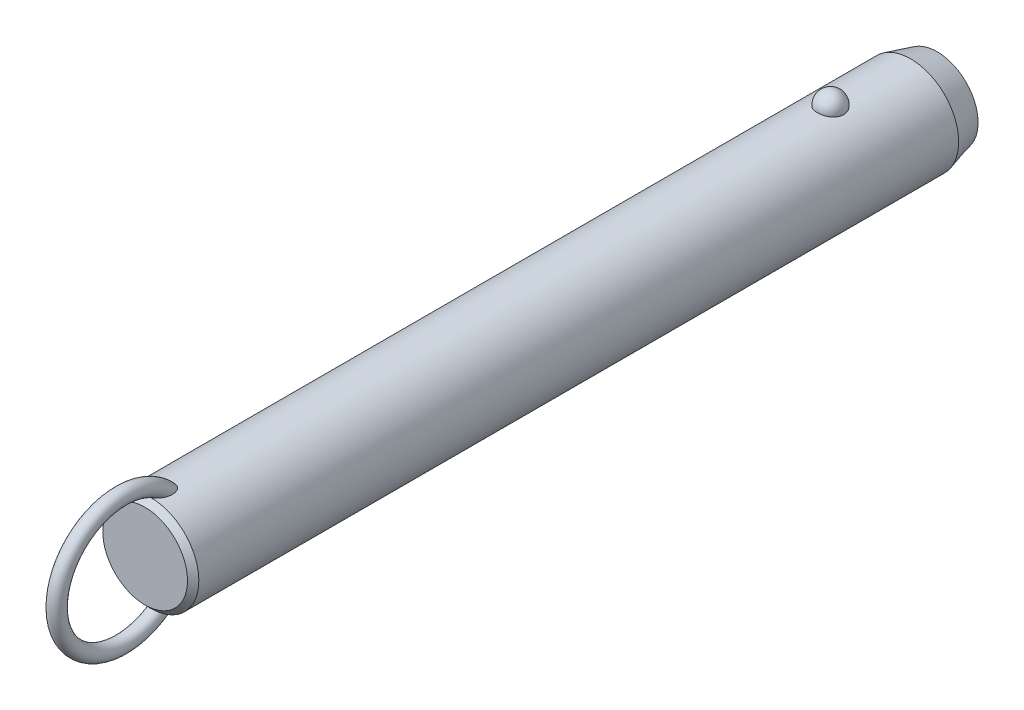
ISO-10303-21;
HEADER;
FILE_DESCRIPTION(('STEP AP214'),'2;1');
FILE_NAME('part.step','',(''),(''),'','','');
FILE_SCHEMA(('AUTOMOTIVE_DESIGN { 1 0 10303 214 1 1 1 1 }'));
ENDSEC;
DATA;
#1=APPLICATION_CONTEXT('core data for automotive mechanical design processes');
#2=APPLICATION_PROTOCOL_DEFINITION('international standard','automotive_design',2000,#1);
#3=PRODUCT_CONTEXT('',#1,'mechanical');
#4=PRODUCT('Part','Part','',(#3));
#5=PRODUCT_RELATED_PRODUCT_CATEGORY('part','',(#4));
#6=PRODUCT_DEFINITION_FORMATION('','',#4);
#7=PRODUCT_DEFINITION_CONTEXT('part definition',#1,'design');
#8=PRODUCT_DEFINITION('design','',#6,#7);
#9=PRODUCT_DEFINITION_SHAPE('','',#8);
#10=(LENGTH_UNIT() NAMED_UNIT(*) SI_UNIT(.MILLI.,.METRE.));
#11=(NAMED_UNIT(*) PLANE_ANGLE_UNIT() SI_UNIT($,.RADIAN.));
#12=(NAMED_UNIT(*) SI_UNIT($,.STERADIAN.) SOLID_ANGLE_UNIT());
#13=UNCERTAINTY_MEASURE_WITH_UNIT(LENGTH_MEASURE(1.E-05),#10,'distance_accuracy_value','');
#14=(GEOMETRIC_REPRESENTATION_CONTEXT(3) GLOBAL_UNCERTAINTY_ASSIGNED_CONTEXT((#13)) GLOBAL_UNIT_ASSIGNED_CONTEXT((#10,
#11,#12)) REPRESENTATION_CONTEXT('',''));
#15=CARTESIAN_POINT('',(0.,0.,0.));
#16=DIRECTION('',(0.,0.,1.));
#17=DIRECTION('',(1.,0.,0.));
#18=AXIS2_PLACEMENT_3D('',#15,#16,#17);
#19=CARTESIAN_POINT('',(0.,0.,165.1));
#20=DIRECTION('',(0.,0.,-1.));
#21=DIRECTION('',(-1.,0.,0.));
#22=AXIS2_PLACEMENT_3D('',#19,#20,#21);
#23=CYLINDRICAL_SURFACE('',#22,12.7);
#24=CARTESIAN_POINT('',(3.46661256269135,12.2177165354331,-3.50000000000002));
#25=CARTESIAN_POINT('',(3.4666090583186,12.2177194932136,-3.30432790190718));
#26=CARTESIAN_POINT('',(3.45063567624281,12.2222841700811,-3.10861112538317));
#27=CARTESIAN_POINT('',(3.38712451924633,12.2400345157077,-2.72271899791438));
#28=CARTESIAN_POINT('',(3.33957415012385,12.2532236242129,-2.53254588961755));
#29=CARTESIAN_POINT('',(3.2141234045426,12.286724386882,-2.16324948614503));
#30=CARTESIAN_POINT('',(3.13623639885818,12.3070329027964,-1.98412136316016));
#31=CARTESIAN_POINT('',(2.95205930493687,12.3525018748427,-1.6418059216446));
#32=CARTESIAN_POINT('',(2.84577003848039,12.3776621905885,-1.47861814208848));
#33=CARTESIAN_POINT('',(2.60688050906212,12.4301712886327,-1.17190583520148));
#34=CARTESIAN_POINT('',(2.47415697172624,12.4575299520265,-1.0284789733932));
#35=CARTESIAN_POINT('',(2.18615174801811,12.5112810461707,-0.766177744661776));
#36=CARTESIAN_POINT('',(2.03087002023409,12.5376734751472,-0.647303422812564));
#37=CARTESIAN_POINT('',(1.70237334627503,12.5864761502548,-0.437732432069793));
#38=CARTESIAN_POINT('',(1.52920948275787,12.6088972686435,-0.346958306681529));
#39=CARTESIAN_POINT('',(1.16944170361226,12.6473352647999,-0.195750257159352));
#40=CARTESIAN_POINT('',(0.982839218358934,12.663352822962,-0.135313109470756));
#41=CARTESIAN_POINT('',(0.604961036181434,12.6869706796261,-0.0473241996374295));
#42=CARTESIAN_POINT('',(0.41382314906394,12.6947125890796,-0.0192185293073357));
#43=CARTESIAN_POINT('',(0.0293827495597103,12.7014203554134,0.00517254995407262));
#44=CARTESIAN_POINT('',(-0.163919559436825,12.7003870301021,0.00146092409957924));
#45=CARTESIAN_POINT('',(-0.544374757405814,12.689735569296,-0.0373939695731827));
#46=CARTESIAN_POINT('',(-0.731575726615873,12.6802364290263,-0.0721015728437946));
#47=CARTESIAN_POINT('',(-1.09733277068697,12.6538333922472,-0.171364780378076));
#48=CARTESIAN_POINT('',(-1.27588869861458,12.6369293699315,-0.235920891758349));
#49=CARTESIAN_POINT('',(-1.6204698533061,12.5973946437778,-0.393548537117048));
#50=CARTESIAN_POINT('',(-1.78641865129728,12.5747321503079,-0.486778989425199));
#51=CARTESIAN_POINT('',(-2.10030671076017,12.5261316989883,-0.699110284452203));
#52=CARTESIAN_POINT('',(-2.24824419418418,12.5001934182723,-0.818213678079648));
#53=CARTESIAN_POINT('',(-2.52491489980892,12.4472906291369,-1.0815712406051));
#54=CARTESIAN_POINT('',(-2.65324222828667,12.4203160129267,-1.22624992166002));
#55=CARTESIAN_POINT('',(-2.88410007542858,12.3687509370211,-1.53528325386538));
#56=CARTESIAN_POINT('',(-2.98662883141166,12.3441606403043,-1.69963924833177));
#57=CARTESIAN_POINT('',(-3.16432417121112,12.2998199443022,-2.04548497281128));
#58=CARTESIAN_POINT('',(-3.23917525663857,12.2801261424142,-2.22714424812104));
#59=CARTESIAN_POINT('',(-3.35800573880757,12.248167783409,-2.60091389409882));
#60=CARTESIAN_POINT('',(-3.4019860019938,12.2359030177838,-2.79302397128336));
#61=CARTESIAN_POINT('',(-3.45784812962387,12.2202347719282,-3.18140279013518));
#62=CARTESIAN_POINT('',(-3.46986123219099,12.2167950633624,-3.37765118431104));
#63=CARTESIAN_POINT('',(-3.46186273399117,12.2190638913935,-3.76943689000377));
#64=CARTESIAN_POINT('',(-3.44185196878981,12.2247721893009,-3.96497421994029));
#65=CARTESIAN_POINT('',(-3.37048652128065,12.2446381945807,-4.34881728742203));
#66=CARTESIAN_POINT('',(-3.31928253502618,12.2587552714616,-4.53715319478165));
#67=CARTESIAN_POINT('',(-3.18693461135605,12.2938237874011,-4.9023172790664));
#68=CARTESIAN_POINT('',(-3.1057895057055,12.3147754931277,-5.07914500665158));
#69=CARTESIAN_POINT('',(-2.91506431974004,12.3613125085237,-5.41732059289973));
#70=CARTESIAN_POINT('',(-2.80533587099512,12.3869217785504,-5.57858147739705));
#71=CARTESIAN_POINT('',(-2.560414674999,12.4398525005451,-5.88013283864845));
#72=CARTESIAN_POINT('',(-2.42522099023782,12.4671740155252,-6.02042254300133));
#73=CARTESIAN_POINT('',(-2.1323357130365,12.5205965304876,-6.27662798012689));
#74=CARTESIAN_POINT('',(-1.97456596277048,12.5466928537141,-6.39245542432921));
#75=CARTESIAN_POINT('',(-1.64115839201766,12.5946384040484,-6.59583547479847));
#76=CARTESIAN_POINT('',(-1.46552179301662,12.6164879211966,-6.68339001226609));
#77=CARTESIAN_POINT('',(-1.10356050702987,12.6532533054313,-6.82682153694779));
#78=CARTESIAN_POINT('',(-0.9173913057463,12.6682500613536,-6.88306988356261));
#79=CARTESIAN_POINT('',(-0.537836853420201,12.6900288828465,-6.96386887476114));
#80=CARTESIAN_POINT('',(-0.344452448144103,12.6968119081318,-6.98842322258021));
#81=CARTESIAN_POINT('',(0.0402577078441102,12.7013667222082,-7.00496469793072));
#82=CARTESIAN_POINT('',(0.231556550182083,12.6993008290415,-6.99753844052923));
#83=CARTESIAN_POINT('',(0.610105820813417,12.6867505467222,-6.95166366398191));
#84=CARTESIAN_POINT('',(0.797356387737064,12.6762664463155,-6.91321620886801));
#85=CARTESIAN_POINT('',(1.16186657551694,12.6480587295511,-6.80658431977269));
#86=CARTESIAN_POINT('',(1.33915951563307,12.6303611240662,-6.73850666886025));
#87=CARTESIAN_POINT('',(1.67968518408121,12.5896027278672,-6.57450875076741));
#88=CARTESIAN_POINT('',(1.84291705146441,12.5665416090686,-6.47858678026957));
#89=CARTESIAN_POINT('',(2.15340192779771,12.5171072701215,-6.25982455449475));
#90=CARTESIAN_POINT('',(2.30037831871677,12.4906895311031,-6.13660186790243));
#91=CARTESIAN_POINT('',(2.5717412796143,12.4376567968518,-5.86739587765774));
#92=CARTESIAN_POINT('',(2.69612388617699,12.4110417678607,-5.72140858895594));
#93=CARTESIAN_POINT('',(2.92107785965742,12.360051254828,-5.40794137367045));
#94=CARTESIAN_POINT('',(3.02121329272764,12.3357209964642,-5.24014110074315));
#95=CARTESIAN_POINT('',(3.19236291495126,12.2925446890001,-4.88969865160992));
#96=CARTESIAN_POINT('',(3.26338839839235,12.2736965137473,-4.70706226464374));
#97=CARTESIAN_POINT('',(3.36788038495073,12.245404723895,-4.35469510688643));
#98=CARTESIAN_POINT('',(3.40484026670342,12.2351018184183,-4.18605935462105));
#99=CARTESIAN_POINT('',(3.45420764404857,12.2212564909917,-3.84496058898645));
#100=CARTESIAN_POINT('',(3.46661565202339,12.2177139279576,-3.67249765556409));
#101=CARTESIAN_POINT('',(3.46661256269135,12.2177165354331,-3.50000000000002));
#102=B_SPLINE_CURVE_WITH_KNOTS('',3,(#24,#25,#26,#27,#28,#29,#30,#31,#32,#33,#34,#35,#36,#37,
#38,#39,#40,#41,#42,#43,#44,#45,#46,#47,#48,#49,#50,#51,#52,#53,#54,#55,#56,#57,#58,#59,#60,#61,
#62,#63,#64,#65,#66,#67,#68,#69,#70,#71,#72,#73,#74,#75,#76,#77,#78,#79,#80,#81,#82,#83,#84,#85,
#86,#87,#88,#89,#90,#91,#92,#93,#94,#95,#96,#97,#98,#99,#100,#101),.UNSPECIFIED.,.T.,.F.,(4,2,2,
2,2,2,2,2,2,2,2,2,2,2,2,2,2,2,2,2,2,2,2,2,2,2,2,2,2,2,2,2,2,2,2,2,2,2,4),(0.,0.586396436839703,
1.17302689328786,1.7593990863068,2.34575431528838,2.93491084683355,3.52406845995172,
4.11158733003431,4.69904375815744,5.2762784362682,5.85345931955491,6.42265312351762,
6.99185659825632,7.56427334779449,8.136746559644,8.71981013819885,9.3029135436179,
9.89247258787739,10.4820150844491,11.0691335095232,11.6562366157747,12.2405256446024,
12.8248374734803,13.412244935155,13.9996740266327,14.5891883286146,15.1786623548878,
15.7609861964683,16.3432419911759,16.9148635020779,17.4864654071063,18.0560241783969,
18.6256177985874,19.2037609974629,19.7820055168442,20.3699810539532,20.957728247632,
21.4746855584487,21.9916320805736),.UNSPECIFIED.);
#103=CARTESIAN_POINT('',(3.46661256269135,12.2177165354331,-3.50000000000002));
#104=VERTEX_POINT('',#103);
#105=EDGE_CURVE('E41',#104,#104,#102,.T.);
#106=ORIENTED_EDGE('',*,*,#105,.T.);
#107=EDGE_LOOP('',(#106));
#108=FACE_BOUND('',#107,.T.);
#109=CARTESIAN_POINT('',(0.,0.,176.3));
#110=DIRECTION('',(0.,0.,1.));
#111=DIRECTION('',(1.,0.,0.));
#112=AXIS2_PLACEMENT_3D('',#109,#110,#111);
#113=CIRCLE('',#112,12.7);
#114=CARTESIAN_POINT('',(12.7,0.,176.3));
#115=VERTEX_POINT('',#114);
#116=EDGE_CURVE('E10',#115,#115,#113,.F.);
#117=ORIENTED_EDGE('',*,*,#116,.T.);
#118=EDGE_LOOP('',(#117));
#119=FACE_BOUND('',#118,.T.);
#120=CARTESIAN_POINT('',(-0.548122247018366,-12.6881662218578,170.043218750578));
#121=CARTESIAN_POINT('',(-0.648865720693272,-12.6838128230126,170.077926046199));
#122=CARTESIAN_POINT('',(-0.746398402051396,-12.6783867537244,170.122042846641));
#123=CARTESIAN_POINT('',(-0.932125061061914,-12.666091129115,170.226764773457));
#124=CARTESIAN_POINT('',(-1.02030388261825,-12.6592192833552,170.287396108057));
#125=CARTESIAN_POINT('',(-1.18487740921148,-12.6448747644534,170.421847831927));
#126=CARTESIAN_POINT('',(-1.26134296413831,-12.637406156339,170.495582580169));
#127=CARTESIAN_POINT('',(-1.4023120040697,-12.6225412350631,170.653604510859));
#128=CARTESIAN_POINT('',(-1.466814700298,-12.6151449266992,170.73789238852));
#129=CARTESIAN_POINT('',(-1.60714786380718,-12.5981718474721,170.949657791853));
#130=CARTESIAN_POINT('',(-1.67725126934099,-12.588900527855,171.080962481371));
#131=CARTESIAN_POINT('',(-1.79536591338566,-12.5725964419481,171.353247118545));
#132=CARTESIAN_POINT('',(-1.84333535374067,-12.5655679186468,171.494244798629));
#133=CARTESIAN_POINT('',(-1.93422576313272,-12.5519624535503,171.837645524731));
#134=CARTESIAN_POINT('',(-1.96788773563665,-12.5466298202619,172.042557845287));
#135=CARTESIAN_POINT('',(-1.9941399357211,-12.542463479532,172.351760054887));
#136=CARTESIAN_POINT('',(-1.99883864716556,-12.5417153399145,172.455298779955));
#137=CARTESIAN_POINT('',(-2.00078003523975,-12.5414074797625,172.66245124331));
#138=CARTESIAN_POINT('',(-1.99802449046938,-12.5418474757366,172.766064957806));
#139=CARTESIAN_POINT('',(-1.98336733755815,-12.5441750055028,173.01032076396));
#140=CARTESIAN_POINT('',(-1.96851430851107,-12.5465291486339,173.150780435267));
#141=CARTESIAN_POINT('',(-1.92707089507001,-12.5529612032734,173.429960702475));
#142=CARTESIAN_POINT('',(-1.90047458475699,-12.5570399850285,173.568680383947));
#143=CARTESIAN_POINT('',(-1.83619120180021,-12.5666008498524,173.84341135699));
#144=CARTESIAN_POINT('',(-1.79850828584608,-12.57208240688,173.979423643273));
#145=CARTESIAN_POINT('',(-1.71223796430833,-12.5841228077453,174.247842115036));
#146=CARTESIAN_POINT('',(-1.66365679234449,-12.5906810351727,174.380250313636));
#147=CARTESIAN_POINT('',(-1.57804503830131,-12.6016176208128,174.58548877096));
#148=CARTESIAN_POINT('',(-1.54477252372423,-12.6057501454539,174.659914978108));
#149=CARTESIAN_POINT('',(-1.47424480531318,-12.6141930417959,174.806839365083));
#150=CARTESIAN_POINT('',(-1.43699041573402,-12.6185033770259,174.879337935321));
#151=CARTESIAN_POINT('',(-1.35825795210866,-12.6272207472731,175.021892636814));
#152=CARTESIAN_POINT('',(-1.31678520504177,-12.6316276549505,175.091951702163));
#153=CARTESIAN_POINT('',(-1.22917793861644,-12.6404532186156,175.229070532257));
#154=CARTESIAN_POINT('',(-1.18304514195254,-12.6448718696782,175.296131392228));
#155=CARTESIAN_POINT('',(-1.07246411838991,-12.6547893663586,175.443874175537));
#156=CARTESIAN_POINT('',(-1.0064223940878,-12.6602600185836,175.523384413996));
#157=CARTESIAN_POINT('',(-0.864441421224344,-12.6707460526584,175.673169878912));
#158=CARTESIAN_POINT('',(-0.788516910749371,-12.6757620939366,175.743458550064));
#159=CARTESIAN_POINT('',(-0.652215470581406,-12.6833591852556,175.848680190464));
#160=CARTESIAN_POINT('',(-0.594982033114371,-12.6861973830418,175.887624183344));
#161=CARTESIAN_POINT('',(-0.475269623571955,-12.6912445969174,175.956489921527));
#162=CARTESIAN_POINT('',(-0.412800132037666,-12.6934547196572,175.986427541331));
#163=CARTESIAN_POINT('',(-0.295749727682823,-12.6966636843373,176.02975652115));
#164=CARTESIAN_POINT('',(-0.241949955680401,-12.6978134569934,176.045218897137));
#165=CARTESIAN_POINT('',(-0.132508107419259,-12.6994261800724,176.066884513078));
#166=CARTESIAN_POINT('',(-0.0768679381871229,-12.6998898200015,176.073097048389));
#167=CARTESIAN_POINT('',(0.0347696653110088,-12.7000752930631,176.075583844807));
#168=CARTESIAN_POINT('',(0.0907676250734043,-12.6997954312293,176.071835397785));
#169=CARTESIAN_POINT('',(0.201283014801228,-12.6985255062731,176.054788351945));
#170=CARTESIAN_POINT('',(0.255799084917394,-12.6975348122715,176.041481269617));
#171=CARTESIAN_POINT('',(0.376042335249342,-12.6946091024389,176.00203792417));
#172=CARTESIAN_POINT('',(0.440950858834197,-12.6924943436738,175.973449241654));
#173=CARTESIAN_POINT('',(0.56535027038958,-12.6875639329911,175.906323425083));
#174=CARTESIAN_POINT('',(0.624828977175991,-12.6847467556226,175.867764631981));
#175=CARTESIAN_POINT('',(0.774116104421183,-12.6767252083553,175.756949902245));
#176=CARTESIAN_POINT('',(0.859449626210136,-12.6711344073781,175.678760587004));
#177=CARTESIAN_POINT('',(1.01789440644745,-12.6593922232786,175.510943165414));
#178=CARTESIAN_POINT('',(1.09096902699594,-12.653239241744,175.421282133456));
#179=CARTESIAN_POINT('',(1.22268793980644,-12.6411674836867,175.240265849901));
#180=CARTESIAN_POINT('',(1.28193986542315,-12.6352572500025,175.149345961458));
#181=CARTESIAN_POINT('',(1.39259777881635,-12.6235401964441,174.962792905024));
#182=CARTESIAN_POINT('',(1.44399707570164,-12.6177334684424,174.867155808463));
#183=CARTESIAN_POINT('',(1.53972870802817,-12.6064093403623,174.672273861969));
#184=CARTESIAN_POINT('',(1.58405262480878,-12.6008922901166,174.573024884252));
#185=CARTESIAN_POINT('',(1.66600705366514,-12.5903187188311,174.371772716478));
#186=CARTESIAN_POINT('',(1.70363651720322,-12.5852622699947,174.269769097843));
#187=CARTESIAN_POINT('',(1.77545379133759,-12.5753406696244,174.054358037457));
#188=CARTESIAN_POINT('',(1.80903453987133,-12.5705328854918,173.940745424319));
#189=CARTESIAN_POINT('',(1.86844163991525,-12.5618400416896,173.711457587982));
#190=CARTESIAN_POINT('',(1.89426665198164,-12.5579551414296,173.595782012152));
#191=CARTESIAN_POINT('',(1.9378546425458,-12.5513030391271,173.363007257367));
#192=CARTESIAN_POINT('',(1.95562640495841,-12.5485346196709,173.245909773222));
#193=CARTESIAN_POINT('',(1.98264463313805,-12.5442934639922,173.010747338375));
#194=CARTESIAN_POINT('',(1.99189298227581,-12.5428204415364,172.89268260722));
#195=CARTESIAN_POINT('',(2.00416068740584,-12.540871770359,172.580622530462));
#196=CARTESIAN_POINT('',(1.99944433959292,-12.541631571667,172.386229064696));
#197=CARTESIAN_POINT('',(1.96113755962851,-12.5476846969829,172.000309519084));
#198=CARTESIAN_POINT('',(1.92758341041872,-12.5529723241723,171.808780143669));
#199=CARTESIAN_POINT('',(1.83934342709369,-12.5661532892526,171.482272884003));
#200=CARTESIAN_POINT('',(1.79215440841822,-12.5730485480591,171.34524997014));
#201=CARTESIAN_POINT('',(1.67676242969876,-12.588958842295,171.080445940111));
#202=CARTESIAN_POINT('',(1.60859050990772,-12.597970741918,170.952651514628));
#203=CARTESIAN_POINT('',(1.46583832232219,-12.6152829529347,170.735800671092));
#204=CARTESIAN_POINT('',(1.39525727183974,-12.6233659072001,170.64410500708));
#205=CARTESIAN_POINT('',(1.23992594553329,-12.6395676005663,170.473485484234));
#206=CARTESIAN_POINT('',(1.15517932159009,-12.6476863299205,170.394558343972));
#207=CARTESIAN_POINT('',(0.971995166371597,-12.6630846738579,170.252643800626));
#208=CARTESIAN_POINT('',(0.873456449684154,-12.6703572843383,170.189784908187));
#209=CARTESIAN_POINT('',(0.665847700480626,-12.6829569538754,170.084487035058));
#210=CARTESIAN_POINT('',(0.556784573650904,-12.688285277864,170.042034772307));
#211=CARTESIAN_POINT('',(0.347338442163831,-12.6956226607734,169.984443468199));
#212=CARTESIAN_POINT('',(0.247759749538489,-12.6979816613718,169.966399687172));
#213=CARTESIAN_POINT('',(0.047021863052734,-12.7003077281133,169.948600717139));
#214=CARTESIAN_POINT('',(-0.0541350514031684,-12.7002779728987,169.948821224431));
#215=CARTESIAN_POINT('',(-0.22141402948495,-12.6982482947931,169.964363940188));
#216=CARTESIAN_POINT('',(-0.288055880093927,-12.6969033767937,169.974666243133));
#217=CARTESIAN_POINT('',(-0.419599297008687,-12.6932369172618,170.00313489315));
#218=CARTESIAN_POINT('',(-0.484501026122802,-12.6909154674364,170.021300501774));
#219=CARTESIAN_POINT('',(-0.548122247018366,-12.6881662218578,170.043218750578));
#220=B_SPLINE_CURVE_WITH_KNOTS('',3,(#120,#121,#122,#123,#124,#125,#126,#127,#128,#129,#130,
#131,#132,#133,#134,#135,#136,#137,#138,#139,#140,#141,#142,#143,#144,#145,#146,#147,#148,#149,
#150,#151,#152,#153,#154,#155,#156,#157,#158,#159,#160,#161,#162,#163,#164,#165,#166,#167,#168,
#169,#170,#171,#172,#173,#174,#175,#176,#177,#178,#179,#180,#181,#182,#183,#184,#185,#186,#187,
#188,#189,#190,#191,#192,#193,#194,#195,#196,#197,#198,#199,#200,#201,#202,#203,#204,#205,#206,
#207,#208,#209,#210,#211,#212,#213,#214,#215,#216,#217,#218,#219),.UNSPECIFIED.,.T.,.F.,(4,2,2,
2,2,2,2,2,2,2,2,2,2,2,2,2,2,2,2,2,2,2,2,2,2,2,2,2,2,2,2,2,2,2,2,2,2,2,2,2,2,2,2,2,2,2,2,2,2,4),
(0.,0.31964225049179,0.639794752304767,0.957927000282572,1.27608021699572,1.72100165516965,
2.16675988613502,2.78630021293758,3.09705782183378,3.40774128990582,3.83096358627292,
4.25439969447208,4.67767724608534,5.1007133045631,5.34550297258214,5.59024267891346,
5.83467707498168,6.07902143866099,6.38891080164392,6.69834321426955,6.90560910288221,
7.11250749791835,7.27977315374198,7.44687060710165,7.61434932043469,7.78197685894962,
7.99365544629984,8.20579780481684,8.55147335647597,8.89816429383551,9.22375138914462,
9.54961437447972,9.87586224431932,10.202161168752,10.557587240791,10.9130746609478,
11.2681734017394,11.6231936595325,12.2046601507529,12.7853961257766,13.219164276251,
13.6522938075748,13.9989174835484,14.3454519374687,14.6946768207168,15.0436740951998,
15.3457513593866,15.6474266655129,15.8493051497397,16.0511646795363),.UNSPECIFIED.);
#221=CARTESIAN_POINT('',(-0.548122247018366,-12.6881662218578,170.043218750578));
#222=VERTEX_POINT('',#221);
#223=EDGE_CURVE('E59',#222,#222,#220,.T.);
#224=ORIENTED_EDGE('',*,*,#223,.T.);
#225=EDGE_LOOP('',(#224));
#226=FACE_BOUND('',#225,.T.);
#227=CARTESIAN_POINT('',(-0.548122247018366,12.6881662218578,170.043218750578));
#228=CARTESIAN_POINT('',(-0.459436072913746,12.6919968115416,170.012673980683));
#229=CARTESIAN_POINT('',(-0.368189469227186,12.6949996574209,169.989391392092));
#230=CARTESIAN_POINT('',(-0.183024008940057,12.6990186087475,169.958406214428));
#231=CARTESIAN_POINT('',(-0.0891049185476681,12.7000345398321,169.950704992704));
#232=CARTESIAN_POINT('',(0.0987147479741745,12.6999636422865,169.951245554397));
#233=CARTESIAN_POINT('',(0.192615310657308,12.6988761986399,169.959492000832));
#234=CARTESIAN_POINT('',(0.377658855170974,12.6947211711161,169.991551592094));
#235=CARTESIAN_POINT('',(0.468801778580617,12.6916535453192,170.015365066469));
#236=CARTESIAN_POINT('',(0.645809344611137,12.6838788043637,170.07745651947));
#237=CARTESIAN_POINT('',(0.731679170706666,12.6791733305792,170.115720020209));
#238=CARTESIAN_POINT('',(0.896315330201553,12.6686004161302,170.205120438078));
#239=CARTESIAN_POINT('',(0.97508059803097,12.6627328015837,170.256259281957));
#240=CARTESIAN_POINT('',(1.12963655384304,12.6499161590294,170.37367820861));
#241=CARTESIAN_POINT('',(1.20478673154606,12.6429194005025,170.440792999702));
#242=CARTESIAN_POINT('',(1.34448241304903,12.6288282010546,170.58522507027));
#243=CARTESIAN_POINT('',(1.40902173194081,12.621733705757,170.662548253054));
#244=CARTESIAN_POINT('',(1.55208211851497,12.6050877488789,170.859247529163));
#245=CARTESIAN_POINT('',(1.62510490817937,12.5957546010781,170.982654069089));
#246=CARTESIAN_POINT('',(1.7501904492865,12.5789823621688,171.239769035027));
#247=CARTESIAN_POINT('',(1.8022137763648,12.5715468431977,171.373496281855));
#248=CARTESIAN_POINT('',(1.90309965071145,12.5567434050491,171.698351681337));
#249=CARTESIAN_POINT('',(1.94342317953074,12.5504515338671,171.892161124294));
#250=CARTESIAN_POINT('',(1.99332997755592,12.5426147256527,172.28378810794));
#251=CARTESIAN_POINT('',(2.00285305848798,12.5410790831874,172.481612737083));
#252=CARTESIAN_POINT('',(1.99678999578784,12.5420407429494,172.816642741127));
#253=CARTESIAN_POINT('',(1.98794117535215,12.5434564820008,172.954042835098));
#254=CARTESIAN_POINT('',(1.95865119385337,12.5480641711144,173.227639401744));
#255=CARTESIAN_POINT('',(1.93820436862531,12.5512569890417,173.363835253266));
#256=CARTESIAN_POINT('',(1.88647896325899,12.5591352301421,173.634249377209));
#257=CARTESIAN_POINT('',(1.85518800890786,12.5638223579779,173.768465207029));
#258=CARTESIAN_POINT('',(1.78217886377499,12.5743868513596,174.033936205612));
#259=CARTESIAN_POINT('',(1.74046509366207,12.5802637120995,174.165192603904));
#260=CARTESIAN_POINT('',(1.66024095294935,12.5910571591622,174.386085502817));
#261=CARTESIAN_POINT('',(1.62434772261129,12.5957535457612,174.476690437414));
#262=CARTESIAN_POINT('',(1.54709009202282,12.6054762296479,174.655512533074));
#263=CARTESIAN_POINT('',(1.50572681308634,12.6105024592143,174.743730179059));
#264=CARTESIAN_POINT('',(1.41728020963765,12.620748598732,174.916932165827));
#265=CARTESIAN_POINT('',(1.37021377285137,12.625967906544,175.001925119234));
#266=CARTESIAN_POINT('',(1.26969620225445,12.6364721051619,175.168007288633));
#267=CARTESIAN_POINT('',(1.21624929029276,12.6417569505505,175.249099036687));
#268=CARTESIAN_POINT('',(1.1030441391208,12.6521331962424,175.404702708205));
#269=CARTESIAN_POINT('',(1.04340936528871,12.657226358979,175.479303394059));
#270=CARTESIAN_POINT('',(0.915919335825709,12.667090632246,175.621324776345));
#271=CARTESIAN_POINT('',(0.848064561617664,12.6718617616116,175.68874589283));
#272=CARTESIAN_POINT('',(0.717035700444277,12.67987711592,175.800624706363));
#273=CARTESIAN_POINT('',(0.655526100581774,12.6832377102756,175.846997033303));
#274=CARTESIAN_POINT('',(0.525985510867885,12.6892676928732,175.929619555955));
#275=CARTESIAN_POINT('',(0.457969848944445,12.6919386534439,175.965892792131));
#276=CARTESIAN_POINT('',(0.334859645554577,12.695691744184,176.016657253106));
#277=CARTESIAN_POINT('',(0.281116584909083,12.6970073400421,176.034373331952));
#278=CARTESIAN_POINT('',(0.171425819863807,12.6989609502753,176.060642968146));
#279=CARTESIAN_POINT('',(0.115480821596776,12.699599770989,176.069207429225));
#280=CARTESIAN_POINT('',(0.00272618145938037,12.7001251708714,176.076253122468));
#281=CARTESIAN_POINT('',(-0.0540859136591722,12.7000089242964,176.074696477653));
#282=CARTESIAN_POINT('',(-0.16654462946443,12.6990328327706,176.061600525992));
#283=CARTESIAN_POINT('',(-0.222190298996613,12.6981724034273,176.050053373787));
#284=CARTESIAN_POINT('',(-0.342018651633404,12.695562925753,176.014912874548));
#285=CARTESIAN_POINT('',(-0.405606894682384,12.6936676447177,175.98933225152));
#286=CARTESIAN_POINT('',(-0.527815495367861,12.6891754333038,175.928311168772));
#287=CARTESIAN_POINT('',(-0.586425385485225,12.6865770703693,175.892850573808));
#288=CARTESIAN_POINT('',(-0.731842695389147,12.6792129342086,175.791496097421));
#289=CARTESIAN_POINT('',(-0.814709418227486,12.6740767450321,175.7200395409));
#290=CARTESIAN_POINT('',(-0.969101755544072,12.6632083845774,175.56589007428));
#291=CARTESIAN_POINT('',(-1.04059564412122,12.6574746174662,175.483166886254));
#292=CARTESIAN_POINT('',(-1.16981116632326,12.6461638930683,175.315809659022));
#293=CARTESIAN_POINT('',(-1.22811369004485,12.6405994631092,175.231616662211));
#294=CARTESIAN_POINT('',(-1.33743405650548,12.6295007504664,175.058579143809));
#295=CARTESIAN_POINT('',(-1.38844577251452,12.6239664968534,174.969730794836));
#296=CARTESIAN_POINT('',(-1.48400702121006,12.6130898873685,174.788389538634));
#297=CARTESIAN_POINT('',(-1.52854232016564,12.6077479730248,174.695889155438));
#298=CARTESIAN_POINT('',(-1.61150113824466,12.5974127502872,174.508160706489));
#299=CARTESIAN_POINT('',(-1.64992317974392,12.5924195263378,174.412931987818));
#300=CARTESIAN_POINT('',(-1.73468589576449,12.581070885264,174.18289362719));
#301=CARTESIAN_POINT('',(-1.77831261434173,12.5749388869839,174.047066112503));
#302=CARTESIAN_POINT('',(-1.85439734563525,12.5639437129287,173.772212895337));
#303=CARTESIAN_POINT('',(-1.88684994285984,12.5590811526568,173.633185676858));
#304=CARTESIAN_POINT('',(-1.94008483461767,12.550968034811,173.35309235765));
#305=CARTESIAN_POINT('',(-1.96088706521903,12.5477147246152,173.212030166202));
#306=CARTESIAN_POINT('',(-1.99000539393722,12.5431291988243,172.928668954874));
#307=CARTESIAN_POINT('',(-1.99832911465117,12.5417958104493,172.786370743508));
#308=CARTESIAN_POINT('',(-2.00166624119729,12.5412674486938,172.457627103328));
#309=CARTESIAN_POINT('',(-1.99178843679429,12.5428579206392,172.271088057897));
#310=CARTESIAN_POINT('',(-1.94455183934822,12.5502731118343,171.90162404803));
#311=CARTESIAN_POINT('',(-1.90724032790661,12.5560905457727,171.718693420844));
#312=CARTESIAN_POINT('',(-1.81330718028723,12.5699462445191,171.404848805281));
#313=CARTESIAN_POINT('',(-1.76338820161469,12.5771273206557,171.271910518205));
#314=CARTESIAN_POINT('',(-1.64305018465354,12.593414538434,171.015681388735));
#315=CARTESIAN_POINT('',(-1.57265346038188,12.6025185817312,170.892380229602));
#316=CARTESIAN_POINT('',(-1.42634956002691,12.6198178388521,170.683564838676));
#317=CARTESIAN_POINT('',(-1.35423772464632,12.6278405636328,170.595384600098));
#318=CARTESIAN_POINT('',(-1.19645664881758,12.6437632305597,170.432107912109));
#319=CARTESIAN_POINT('',(-1.1108053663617,12.6516633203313,170.356994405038));
#320=CARTESIAN_POINT('',(-0.947219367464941,12.6648319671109,170.237811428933));
#321=CARTESIAN_POINT('',(-0.871624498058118,12.670300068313,170.190541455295));
#322=CARTESIAN_POINT('',(-0.714161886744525,12.6801492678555,170.1077413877));
#323=CARTESIAN_POINT('',(-0.632295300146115,12.684530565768,170.07220913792));
#324=CARTESIAN_POINT('',(-0.548122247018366,12.6881662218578,170.043218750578));
#325=B_SPLINE_CURVE_WITH_KNOTS('',3,(#227,#228,#229,#230,#231,#232,#233,#234,#235,#236,#237,
#238,#239,#240,#241,#242,#243,#244,#245,#246,#247,#248,#249,#250,#251,#252,#253,#254,#255,#256,
#257,#258,#259,#260,#261,#262,#263,#264,#265,#266,#267,#268,#269,#270,#271,#272,#273,#274,#275,
#276,#277,#278,#279,#280,#281,#282,#283,#284,#285,#286,#287,#288,#289,#290,#291,#292,#293,#294,
#295,#296,#297,#298,#299,#300,#301,#302,#303,#304,#305,#306,#307,#308,#309,#310,#311,#312,#313,
#314,#315,#316,#317,#318,#319,#320,#321,#322,#323,#324),.UNSPECIFIED.,.T.,.F.,(4,2,2,2,2,2,2,2,
2,2,2,2,2,2,2,2,2,2,2,2,2,2,2,2,2,2,2,2,2,2,2,2,2,2,2,2,2,2,2,2,2,2,2,2,2,2,2,2,4),(0.,
0.281328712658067,0.562682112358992,0.844117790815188,1.12555942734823,1.40671982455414,
1.68792232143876,1.98972294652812,2.29169886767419,2.72039860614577,3.14989948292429,
3.74084916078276,4.33295293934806,4.74554109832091,5.15833092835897,5.5715933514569,
5.98468079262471,6.27722775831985,6.56971484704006,6.86135609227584,7.15280542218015,
7.43927407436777,7.72572595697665,7.95635862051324,8.18646071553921,8.35559393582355,
8.52452541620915,8.69408946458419,8.86378678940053,9.06834348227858,9.27332014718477,
9.6001041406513,9.92778432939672,10.2350252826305,10.5425229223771,10.8506864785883,
11.15892440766,11.5867893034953,12.0148612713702,12.4421984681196,12.8692745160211,
13.4279365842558,13.9856380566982,14.4107062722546,14.835313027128,15.1765567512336,
15.517351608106,15.7844129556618,16.051425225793),.UNSPECIFIED.);
#326=CARTESIAN_POINT('',(-0.548122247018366,12.6881662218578,170.043218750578));
#327=VERTEX_POINT('',#326);
#328=EDGE_CURVE('E66',#327,#327,#325,.T.);
#329=ORIENTED_EDGE('',*,*,#328,.T.);
#330=EDGE_LOOP('',(#329));
#331=FACE_BOUND('',#330,.T.);
#332=CARTESIAN_POINT('',(0.,0.,-24.6999999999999));
#333=DIRECTION('',(0.,0.,-1.));
#334=DIRECTION('',(-1.,0.,0.));
#335=AXIS2_PLACEMENT_3D('',#332,#333,#334);
#336=CIRCLE('',#335,12.7);
#337=CARTESIAN_POINT('',(-12.7,0.,-24.6999999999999));
#338=VERTEX_POINT('',#337);
#339=EDGE_CURVE('E56',#338,#338,#336,.F.);
#340=ORIENTED_EDGE('',*,*,#339,.T.);
#341=EDGE_LOOP('',(#340));
#342=FACE_BOUND('',#341,.T.);
#343=ADVANCED_FACE('F37',(#108,#119,#226,#331,#342),#23,.T.);
#344=CARTESIAN_POINT('',(0.,0.,-31.7));
#345=DIRECTION('',(0.,0.,-1.));
#346=DIRECTION('',(-1.,0.,0.));
#347=AXIS2_PLACEMENT_3D('',#344,#345,#346);
#348=PLANE('',#347);
#349=CARTESIAN_POINT('',(0.,0.,-31.7));
#350=DIRECTION('',(0.,0.,-1.));
#351=DIRECTION('',(-1.,0.,0.));
#352=AXIS2_PLACEMENT_3D('',#349,#350,#351);
#353=CIRCLE('',#352,10.8243556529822);
#354=CARTESIAN_POINT('',(-10.8243556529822,0.,-31.7));
#355=VERTEX_POINT('',#354);
#356=EDGE_CURVE('E65',#355,#355,#353,.T.);
#357=ORIENTED_EDGE('',*,*,#356,.T.);
#358=EDGE_LOOP('',(#357));
#359=FACE_BOUND('',#358,.T.);
#360=ADVANCED_FACE('F84',(#359),#348,.T.);
#361=CARTESIAN_POINT('',(0.,0.,-31.7));
#362=DIRECTION('',(0.,0.,1.));
#363=DIRECTION('',(1.,0.,0.));
#364=AXIS2_PLACEMENT_3D('',#361,#362,#363);
#365=CONICAL_SURFACE('',#364,10.8243556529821,0.261799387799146);
#366=ORIENTED_EDGE('',*,*,#339,.F.);
#367=EDGE_LOOP('',(#366));
#368=FACE_BOUND('',#367,.T.);
#369=ORIENTED_EDGE('',*,*,#356,.F.);
#370=EDGE_LOOP('',(#369));
#371=FACE_BOUND('',#370,.T.);
#372=ADVANCED_FACE('F82',(#368,#371),#365,.T.);
#373=CARTESIAN_POINT('',(0.,0.,177.8));
#374=DIRECTION('',(0.,0.,1.));
#375=DIRECTION('',(1.,0.,0.));
#376=AXIS2_PLACEMENT_3D('',#373,#374,#375);
#377=PLANE('',#376);
#378=CARTESIAN_POINT('',(0.,0.,177.8));
#379=DIRECTION('',(0.,0.,1.));
#380=DIRECTION('',(1.,0.,0.));
#381=AXIS2_PLACEMENT_3D('',#378,#379,#380);
#382=CIRCLE('',#381,11.2);
#383=CARTESIAN_POINT('',(11.2,0.,177.8));
#384=VERTEX_POINT('',#383);
#385=EDGE_CURVE('E50',#384,#384,#382,.T.);
#386=ORIENTED_EDGE('',*,*,#385,.T.);
#387=EDGE_LOOP('',(#386));
#388=FACE_BOUND('',#387,.T.);
#389=ADVANCED_FACE('F76',(#388),#377,.T.);
#390=CARTESIAN_POINT('',(0.,0.,184.15));
#391=DIRECTION('',(1.,0.,0.));
#392=DIRECTION('',(0.,0.,-1.));
#393=AXIS2_PLACEMENT_3D('',#390,#391,#392);
#394=TOROIDAL_SURFACE('',#393,17.05,2.);
#395=ORIENTED_EDGE('',*,*,#328,.F.);
#396=EDGE_LOOP('',(#395));
#397=FACE_BOUND('',#396,.T.);
#398=ORIENTED_EDGE('',*,*,#223,.F.);
#399=EDGE_LOOP('',(#398));
#400=FACE_BOUND('',#399,.T.);
#401=ADVANCED_FACE('F72',(#397,#400),#394,.T.);
#402=CARTESIAN_POINT('',(0.,0.,177.8));
#403=DIRECTION('',(0.,0.,-1.));
#404=DIRECTION('',(-1.,0.,0.));
#405=AXIS2_PLACEMENT_3D('',#402,#403,#404);
#406=CONICAL_SURFACE('',#405,11.2,0.785398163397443);
#407=ORIENTED_EDGE('',*,*,#116,.F.);
#408=EDGE_LOOP('',(#407));
#409=FACE_BOUND('',#408,.T.);
#410=ORIENTED_EDGE('',*,*,#385,.F.);
#411=EDGE_LOOP('',(#410));
#412=FACE_BOUND('',#411,.T.);
#413=ADVANCED_FACE('F39',(#409,#412),#406,.T.);
#414=CARTESIAN_POINT('',(0.,12.7,-3.50000000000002));
#415=DIRECTION('',(0.,1.,0.));
#416=DIRECTION('',(0.,0.,-1.));
#417=AXIS2_PLACEMENT_3D('',#414,#415,#416);
#418=SPHERICAL_SURFACE('',#417,3.5);
#419=ORIENTED_EDGE('',*,*,#105,.F.);
#420=EDGE_LOOP('',(#419));
#421=FACE_BOUND('',#420,.T.);
#422=ADVANCED_FACE('F78',(#421),#418,.T.);
#423=CLOSED_SHELL('',(#343,#360,#372,#389,#401,#413,#422));
#424=MANIFOLD_SOLID_BREP('B2',#423);
#425=ADVANCED_BREP_SHAPE_REPRESENTATION('',(#18,#424),#14);
#426=SHAPE_DEFINITION_REPRESENTATION(#9,#425);
ENDSEC;
END-ISO-10303-21;
